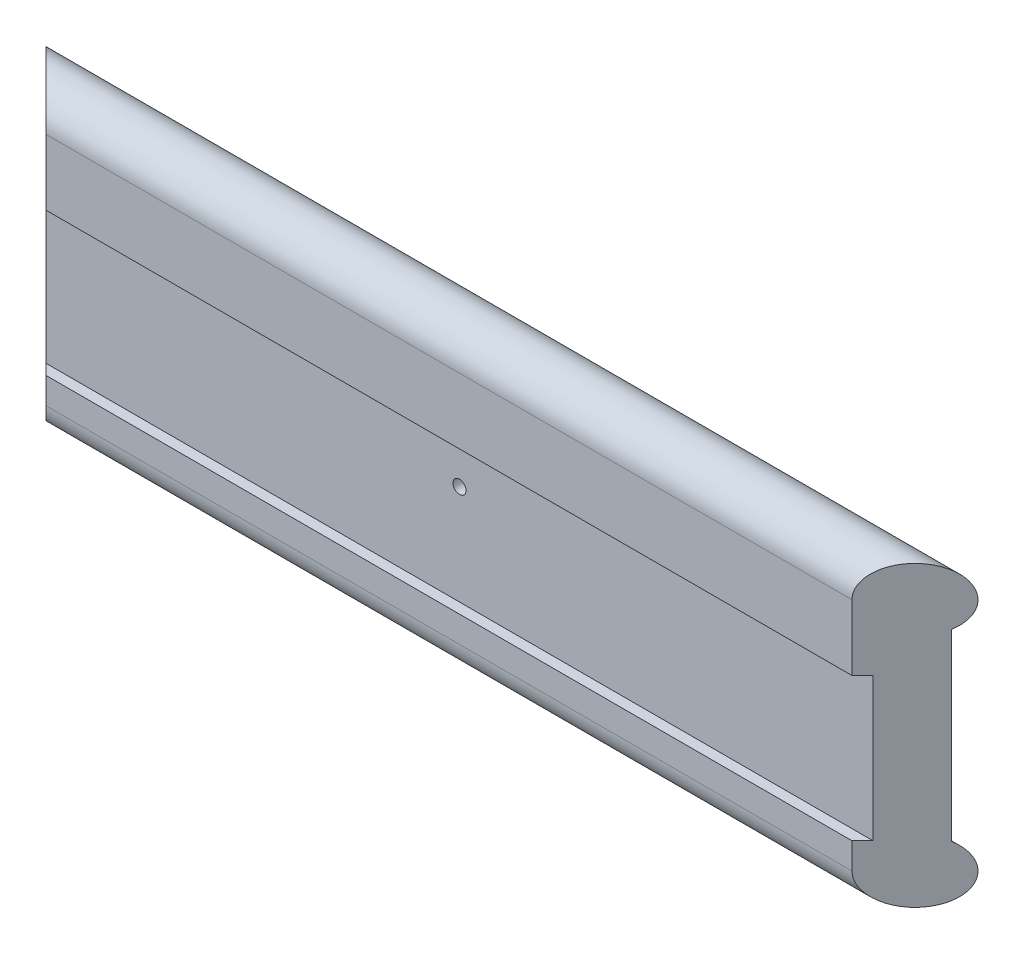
ISO-10303-21;
HEADER;
FILE_DESCRIPTION(('STEP AP214'),'2;1');
FILE_NAME('part.step','',(''),(''),'','','');
FILE_SCHEMA(('AUTOMOTIVE_DESIGN { 1 0 10303 214 1 1 1 1 }'));
ENDSEC;
DATA;
#1=APPLICATION_CONTEXT('core data for automotive mechanical design processes');
#2=APPLICATION_PROTOCOL_DEFINITION('international standard','automotive_design',2000,#1);
#3=PRODUCT_CONTEXT('',#1,'mechanical');
#4=PRODUCT('Part','Part','',(#3));
#5=PRODUCT_RELATED_PRODUCT_CATEGORY('part','',(#4));
#6=PRODUCT_DEFINITION_FORMATION('','',#4);
#7=PRODUCT_DEFINITION_CONTEXT('part definition',#1,'design');
#8=PRODUCT_DEFINITION('design','',#6,#7);
#9=PRODUCT_DEFINITION_SHAPE('','',#8);
#10=(LENGTH_UNIT() NAMED_UNIT(*) SI_UNIT(.MILLI.,.METRE.));
#11=(NAMED_UNIT(*) PLANE_ANGLE_UNIT() SI_UNIT($,.RADIAN.));
#12=(NAMED_UNIT(*) SI_UNIT($,.STERADIAN.) SOLID_ANGLE_UNIT());
#13=UNCERTAINTY_MEASURE_WITH_UNIT(LENGTH_MEASURE(1.E-05),#10,'distance_accuracy_value','');
#14=(GEOMETRIC_REPRESENTATION_CONTEXT(3) GLOBAL_UNCERTAINTY_ASSIGNED_CONTEXT((#13)) GLOBAL_UNIT_ASSIGNED_CONTEXT((#10,
#11,#12)) REPRESENTATION_CONTEXT('',''));
#15=CARTESIAN_POINT('',(0.,0.,0.));
#16=DIRECTION('',(0.,0.,1.));
#17=DIRECTION('',(1.,0.,0.));
#18=AXIS2_PLACEMENT_3D('',#15,#16,#17);
#19=CARTESIAN_POINT('',(0.,0.,15.));
#20=DIRECTION('',(0.,0.,-1.));
#21=DIRECTION('',(-1.,0.,0.));
#22=AXIS2_PLACEMENT_3D('',#19,#20,#21);
#23=PLANE('',#22);
#24=CARTESIAN_POINT('',(0.,10.75,15.));
#25=DIRECTION('',(0.,0.,1.));
#26=DIRECTION('',(1.,0.,0.));
#27=AXIS2_PLACEMENT_3D('',#24,#25,#26);
#28=CIRCLE('',#27,2.5);
#29=CARTESIAN_POINT('',(2.5,10.75,15.));
#30=VERTEX_POINT('',#29);
#31=EDGE_CURVE('E173',#30,#30,#28,.T.);
#32=ORIENTED_EDGE('',*,*,#31,.F.);
#33=EDGE_LOOP('',(#32));
#34=FACE_BOUND('',#33,.T.);
#35=DIRECTION('',(-1.,0.,0.));
#36=VECTOR('',#35,1.);
#37=CARTESIAN_POINT('',(-177.5,27.25,15.));
#38=LINE('',#37,#36);
#39=CARTESIAN_POINT('',(157.5,27.25,15.));
#40=VERTEX_POINT('',#39);
#41=CARTESIAN_POINT('',(-157.5,27.25,15.));
#42=VERTEX_POINT('',#41);
#43=EDGE_CURVE('E37',#40,#42,#38,.T.);
#44=ORIENTED_EDGE('',*,*,#43,.T.);
#45=DIRECTION('',(0.,-1.,0.));
#46=VECTOR('',#45,1.);
#47=CARTESIAN_POINT('',(-157.5,0.,15.));
#48=LINE('',#47,#46);
#49=CARTESIAN_POINT('',(-157.5,-27.25,15.));
#50=VERTEX_POINT('',#49);
#51=EDGE_CURVE('E57',#42,#50,#48,.T.);
#52=ORIENTED_EDGE('',*,*,#51,.T.);
#53=DIRECTION('',(1.,0.,0.));
#54=VECTOR('',#53,1.);
#55=CARTESIAN_POINT('',(-177.5,-27.25,15.));
#56=LINE('',#55,#54);
#57=CARTESIAN_POINT('',(157.5,-27.25,15.));
#58=VERTEX_POINT('',#57);
#59=EDGE_CURVE('E106',#50,#58,#56,.T.);
#60=ORIENTED_EDGE('',*,*,#59,.T.);
#61=DIRECTION('',(0.,1.,0.));
#62=VECTOR('',#61,1.);
#63=CARTESIAN_POINT('',(157.5,0.,15.));
#64=LINE('',#63,#62);
#65=EDGE_CURVE('E146',#58,#40,#64,.T.);
#66=ORIENTED_EDGE('',*,*,#65,.T.);
#67=EDGE_LOOP('',(#44,#52,#60,#66));
#68=FACE_BOUND('',#67,.T.);
#69=ADVANCED_FACE('F33',(#34,#68),#23,.F.);
#70=CARTESIAN_POINT('',(0.,0.,0.));
#71=DIRECTION('',(0.,0.,-1.));
#72=DIRECTION('',(-1.,0.,0.));
#73=AXIS2_PLACEMENT_3D('',#70,#71,#72);
#74=PLANE('',#73);
#75=CARTESIAN_POINT('',(0.,10.75,0.));
#76=DIRECTION('',(0.,0.,-1.));
#77=DIRECTION('',(-1.,0.,0.));
#78=AXIS2_PLACEMENT_3D('',#75,#76,#77);
#79=CIRCLE('',#78,2.5);
#80=CARTESIAN_POINT('',(-2.5,10.75,0.));
#81=VERTEX_POINT('',#80);
#82=EDGE_CURVE('E169',#81,#81,#79,.F.);
#83=ORIENTED_EDGE('',*,*,#82,.T.);
#84=EDGE_LOOP('',(#83));
#85=FACE_BOUND('',#84,.T.);
#86=DIRECTION('',(0.,-1.,0.));
#87=VECTOR('',#86,1.);
#88=CARTESIAN_POINT('',(-172.5,0.,0.));
#89=LINE('',#88,#87);
#90=CARTESIAN_POINT('',(-172.5,42.503205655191,0.));
#91=VERTEX_POINT('',#90);
#92=CARTESIAN_POINT('',(-172.5,-27.503205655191,0.));
#93=VERTEX_POINT('',#92);
#94=EDGE_CURVE('E159',#91,#93,#89,.T.);
#95=ORIENTED_EDGE('',*,*,#94,.F.);
#96=DIRECTION('',(-1.,0.,0.));
#97=VECTOR('',#96,1.);
#98=CARTESIAN_POINT('',(221.6021541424,42.503205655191,0.));
#99=LINE('',#98,#97);
#100=CARTESIAN_POINT('',(172.5,42.503205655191,0.));
#101=VERTEX_POINT('',#100);
#102=EDGE_CURVE('E130',#101,#91,#99,.T.);
#103=ORIENTED_EDGE('',*,*,#102,.F.);
#104=DIRECTION('',(0.,1.,0.));
#105=VECTOR('',#104,1.);
#106=CARTESIAN_POINT('',(172.5,0.,0.));
#107=LINE('',#106,#105);
#108=CARTESIAN_POINT('',(172.5,-27.503205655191,0.));
#109=VERTEX_POINT('',#108);
#110=EDGE_CURVE('E166',#109,#101,#107,.T.);
#111=ORIENTED_EDGE('',*,*,#110,.F.);
#112=DIRECTION('',(-1.,0.,0.));
#113=VECTOR('',#112,1.);
#114=CARTESIAN_POINT('',(221.6021541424,-27.503205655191,0.));
#115=LINE('',#114,#113);
#116=EDGE_CURVE('E102',#109,#93,#115,.T.);
#117=ORIENTED_EDGE('',*,*,#116,.T.);
#118=EDGE_LOOP('',(#95,#103,#111,#117));
#119=FACE_BOUND('',#118,.T.);
#120=ADVANCED_FACE('F35',(#85,#119),#74,.T.);
#121=CARTESIAN_POINT('',(221.6021541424,27.25,15.));
#122=DIRECTION('',(0.,-1.,0.));
#123=DIRECTION('',(0.,0.,-1.));
#124=AXIS2_PLACEMENT_3D('',#121,#122,#123);
#125=PLANE('',#124);
#126=DIRECTION('',(0.707106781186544,0.,0.707106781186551));
#127=VECTOR('',#126,1.);
#128=CARTESIAN_POINT('',(32.051077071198,27.25,204.5510770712));
#129=LINE('',#128,#127);
#130=CARTESIAN_POINT('',(-153.5,27.25,19.));
#131=VERTEX_POINT('',#130);
#132=EDGE_CURVE('E126',#42,#131,#129,.T.);
#133=ORIENTED_EDGE('',*,*,#132,.F.);
#134=ORIENTED_EDGE('',*,*,#43,.F.);
#135=DIRECTION('',(0.707106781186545,0.,-0.70710678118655));
#136=VECTOR('',#135,1.);
#137=CARTESIAN_POINT('',(189.5510770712,27.25,-17.0510770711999));
#138=LINE('',#137,#136);
#139=CARTESIAN_POINT('',(153.5,27.25,18.9999999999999));
#140=VERTEX_POINT('',#139);
#141=EDGE_CURVE('E150',#140,#40,#138,.T.);
#142=ORIENTED_EDGE('',*,*,#141,.F.);
#143=DIRECTION('',(-1.,0.,0.));
#144=VECTOR('',#143,1.);
#145=CARTESIAN_POINT('',(221.6021541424,27.25,19.));
#146=LINE('',#145,#144);
#147=EDGE_CURVE('E124',#140,#131,#146,.T.);
#148=ORIENTED_EDGE('',*,*,#147,.T.);
#149=EDGE_LOOP('',(#133,#134,#142,#148));
#150=FACE_BOUND('',#149,.T.);
#151=ADVANCED_FACE('F149',(#150),#125,.T.);
#152=CARTESIAN_POINT('',(221.6021541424,52.25,7.));
#153=DIRECTION('',(-1.,0.,0.));
#154=DIRECTION('',(0.,0.,1.));
#155=AXIS2_PLACEMENT_3D('',#152,#153,#154);
#156=CYLINDRICAL_SURFACE('',#155,12.);
#157=CARTESIAN_POINT('',(-165.5,52.25,7.));
#158=DIRECTION('',(0.707106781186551,0.,-0.707106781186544));
#159=DIRECTION('',(-0.707106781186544,0.,-0.707106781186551));
#160=AXIS2_PLACEMENT_3D('',#157,#158,#159);
#161=ELLIPSE('',#160,16.9705627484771,12.);
#162=CARTESIAN_POINT('',(-153.5,52.25,19.));
#163=VERTEX_POINT('',#162);
#164=EDGE_CURVE('E157',#163,#91,#161,.F.);
#165=ORIENTED_EDGE('',*,*,#164,.F.);
#166=DIRECTION('',(-1.,0.,0.));
#167=VECTOR('',#166,1.);
#168=CARTESIAN_POINT('',(221.6021541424,52.25,19.));
#169=LINE('',#168,#167);
#170=CARTESIAN_POINT('',(153.5,52.25,18.9999999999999));
#171=VERTEX_POINT('',#170);
#172=EDGE_CURVE('E133',#171,#163,#169,.T.);
#173=ORIENTED_EDGE('',*,*,#172,.F.);
#174=CARTESIAN_POINT('',(165.5,52.25,7.));
#175=DIRECTION('',(-0.70710678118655,0.,-0.707106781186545));
#176=DIRECTION('',(-0.707106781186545,0.,0.70710678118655));
#177=AXIS2_PLACEMENT_3D('',#174,#175,#176);
#178=ELLIPSE('',#177,16.9705627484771,12.);
#179=EDGE_CURVE('E164',#101,#171,#178,.F.);
#180=ORIENTED_EDGE('',*,*,#179,.F.);
#181=ORIENTED_EDGE('',*,*,#102,.T.);
#182=EDGE_LOOP('',(#165,#173,#180,#181));
#183=FACE_BOUND('',#182,.T.);
#184=ADVANCED_FACE('F188',(#183),#156,.T.);
#185=CARTESIAN_POINT('',(221.6021541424,27.25,19.));
#186=DIRECTION('',(0.,0.,1.));
#187=DIRECTION('',(0.,-1.,0.));
#188=AXIS2_PLACEMENT_3D('',#185,#186,#187);
#189=PLANE('',#188);
#190=DIRECTION('',(0.,1.,0.));
#191=VECTOR('',#190,1.);
#192=CARTESIAN_POINT('',(-153.5,-49.25,19.));
#193=LINE('',#192,#191);
#194=EDGE_CURVE('E116',#131,#163,#193,.T.);
#195=ORIENTED_EDGE('',*,*,#194,.F.);
#196=ORIENTED_EDGE('',*,*,#147,.F.);
#197=DIRECTION('',(0.,1.,0.));
#198=VECTOR('',#197,1.);
#199=CARTESIAN_POINT('',(153.5,-49.25,18.9999999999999));
#200=LINE('',#199,#198);
#201=EDGE_CURVE('E117',#140,#171,#200,.T.);
#202=ORIENTED_EDGE('',*,*,#201,.T.);
#203=ORIENTED_EDGE('',*,*,#172,.T.);
#204=EDGE_LOOP('',(#195,#196,#202,#203));
#205=FACE_BOUND('',#204,.T.);
#206=ADVANCED_FACE('F189',(#205),#189,.T.);
#207=CARTESIAN_POINT('',(221.6021541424,-27.25,0.));
#208=DIRECTION('',(0.,1.,0.));
#209=DIRECTION('',(0.,0.,1.));
#210=AXIS2_PLACEMENT_3D('',#207,#208,#209);
#211=PLANE('',#210);
#212=DIRECTION('',(-0.707106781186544,0.,-0.707106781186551));
#213=VECTOR('',#212,1.);
#214=CARTESIAN_POINT('',(24.5510770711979,-27.25,197.0510770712));
#215=LINE('',#214,#213);
#216=CARTESIAN_POINT('',(-153.5,-27.25,19.));
#217=VERTEX_POINT('',#216);
#218=EDGE_CURVE('E153',#217,#50,#215,.T.);
#219=ORIENTED_EDGE('',*,*,#218,.F.);
#220=DIRECTION('',(-1.,0.,0.));
#221=VECTOR('',#220,1.);
#222=CARTESIAN_POINT('',(221.6021541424,-27.25,19.));
#223=LINE('',#222,#221);
#224=CARTESIAN_POINT('',(153.5,-27.25,18.9999999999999));
#225=VERTEX_POINT('',#224);
#226=EDGE_CURVE('E122',#225,#217,#223,.T.);
#227=ORIENTED_EDGE('',*,*,#226,.F.);
#228=DIRECTION('',(-0.707106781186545,0.,0.70710678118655));
#229=VECTOR('',#228,1.);
#230=CARTESIAN_POINT('',(197.0510770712,-27.25,-24.5510770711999));
#231=LINE('',#230,#229);
#232=EDGE_CURVE('E112',#58,#225,#231,.T.);
#233=ORIENTED_EDGE('',*,*,#232,.F.);
#234=ORIENTED_EDGE('',*,*,#59,.F.);
#235=EDGE_LOOP('',(#219,#227,#233,#234));
#236=FACE_BOUND('',#235,.T.);
#237=ADVANCED_FACE('F192',(#236),#211,.T.);
#238=CARTESIAN_POINT('',(221.6021541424,-27.25,19.));
#239=DIRECTION('',(0.,0.,1.));
#240=DIRECTION('',(0.,-1.,0.));
#241=AXIS2_PLACEMENT_3D('',#238,#239,#240);
#242=PLANE('',#241);
#243=CARTESIAN_POINT('',(-153.5,-37.25,19.));
#244=VERTEX_POINT('',#243);
#245=EDGE_CURVE('E121',#244,#217,#193,.T.);
#246=ORIENTED_EDGE('',*,*,#245,.F.);
#247=DIRECTION('',(-1.,0.,0.));
#248=VECTOR('',#247,1.);
#249=CARTESIAN_POINT('',(221.6021541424,-37.25,19.));
#250=LINE('',#249,#248);
#251=CARTESIAN_POINT('',(153.5,-37.25,19.));
#252=VERTEX_POINT('',#251);
#253=EDGE_CURVE('E100',#252,#244,#250,.T.);
#254=ORIENTED_EDGE('',*,*,#253,.F.);
#255=EDGE_CURVE('E109',#252,#225,#200,.T.);
#256=ORIENTED_EDGE('',*,*,#255,.T.);
#257=ORIENTED_EDGE('',*,*,#226,.T.);
#258=EDGE_LOOP('',(#246,#254,#256,#257));
#259=FACE_BOUND('',#258,.T.);
#260=ADVANCED_FACE('F120',(#259),#242,.T.);
#261=CARTESIAN_POINT('',(221.6021541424,-37.25,7.));
#262=DIRECTION('',(-1.,0.,0.));
#263=DIRECTION('',(0.,0.,1.));
#264=AXIS2_PLACEMENT_3D('',#261,#262,#263);
#265=CYLINDRICAL_SURFACE('',#264,12.);
#266=CARTESIAN_POINT('',(-165.5,-37.25,7.));
#267=DIRECTION('',(0.707106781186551,0.,-0.707106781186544));
#268=DIRECTION('',(-0.707106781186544,0.,-0.707106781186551));
#269=AXIS2_PLACEMENT_3D('',#266,#267,#268);
#270=ELLIPSE('',#269,16.9705627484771,12.);
#271=EDGE_CURVE('E11',#93,#244,#270,.F.);
#272=ORIENTED_EDGE('',*,*,#271,.F.);
#273=ORIENTED_EDGE('',*,*,#116,.F.);
#274=CARTESIAN_POINT('',(165.5,-37.25,7.));
#275=DIRECTION('',(-0.70710678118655,0.,-0.707106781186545));
#276=DIRECTION('',(-0.707106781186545,0.,0.70710678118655));
#277=AXIS2_PLACEMENT_3D('',#274,#275,#276);
#278=ELLIPSE('',#277,16.9705627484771,12.);
#279=EDGE_CURVE('E43',#252,#109,#278,.F.);
#280=ORIENTED_EDGE('',*,*,#279,.F.);
#281=ORIENTED_EDGE('',*,*,#253,.T.);
#282=EDGE_LOOP('',(#272,#273,#280,#281));
#283=FACE_BOUND('',#282,.T.);
#284=ADVANCED_FACE('F98',(#283),#265,.T.);
#285=CARTESIAN_POINT('',(153.5,-49.25,18.9999999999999));
#286=DIRECTION('',(-0.70710678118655,0.,-0.707106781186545));
#287=DIRECTION('',(-0.707106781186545,0.,0.70710678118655));
#288=AXIS2_PLACEMENT_3D('',#285,#286,#287);
#289=PLANE('',#288);
#290=ORIENTED_EDGE('',*,*,#141,.T.);
#291=ORIENTED_EDGE('',*,*,#65,.F.);
#292=ORIENTED_EDGE('',*,*,#232,.T.);
#293=ORIENTED_EDGE('',*,*,#255,.F.);
#294=ORIENTED_EDGE('',*,*,#279,.T.);
#295=ORIENTED_EDGE('',*,*,#110,.T.);
#296=ORIENTED_EDGE('',*,*,#179,.T.);
#297=ORIENTED_EDGE('',*,*,#201,.F.);
#298=EDGE_LOOP('',(#290,#291,#292,#293,#294,#295,#296,#297));
#299=FACE_BOUND('',#298,.T.);
#300=ADVANCED_FACE('F110',(#299),#289,.F.);
#301=CARTESIAN_POINT('',(-177.5,-49.25,-5.));
#302=DIRECTION('',(0.707106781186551,0.,-0.707106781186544));
#303=DIRECTION('',(-0.707106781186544,0.,-0.707106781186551));
#304=AXIS2_PLACEMENT_3D('',#301,#302,#303);
#305=PLANE('',#304);
#306=ORIENTED_EDGE('',*,*,#132,.T.);
#307=ORIENTED_EDGE('',*,*,#194,.T.);
#308=ORIENTED_EDGE('',*,*,#164,.T.);
#309=ORIENTED_EDGE('',*,*,#94,.T.);
#310=ORIENTED_EDGE('',*,*,#271,.T.);
#311=ORIENTED_EDGE('',*,*,#245,.T.);
#312=ORIENTED_EDGE('',*,*,#218,.T.);
#313=ORIENTED_EDGE('',*,*,#51,.F.);
#314=EDGE_LOOP('',(#306,#307,#308,#309,#310,#311,#312,#313));
#315=FACE_BOUND('',#314,.T.);
#316=ADVANCED_FACE('F206',(#315),#305,.F.);
#317=CARTESIAN_POINT('',(0.,10.75,-7.07106781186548));
#318=DIRECTION('',(0.,0.,1.));
#319=DIRECTION('',(1.,0.,0.));
#320=AXIS2_PLACEMENT_3D('',#317,#318,#319);
#321=CYLINDRICAL_SURFACE('',#320,2.5);
#322=ORIENTED_EDGE('',*,*,#31,.T.);
#323=EDGE_LOOP('',(#322));
#324=FACE_BOUND('',#323,.T.);
#325=ORIENTED_EDGE('',*,*,#82,.F.);
#326=EDGE_LOOP('',(#325));
#327=FACE_BOUND('',#326,.T.);
#328=ADVANCED_FACE('F177',(#324,#327),#321,.F.);
#329=CLOSED_SHELL('',(#69,#120,#151,#184,#206,#237,#260,#284,#300,#316,#328));
#330=MANIFOLD_SOLID_BREP('B2',#329);
#331=ADVANCED_BREP_SHAPE_REPRESENTATION('',(#18,#330),#14);
#332=SHAPE_DEFINITION_REPRESENTATION(#9,#331);
ENDSEC;
END-ISO-10303-21;
